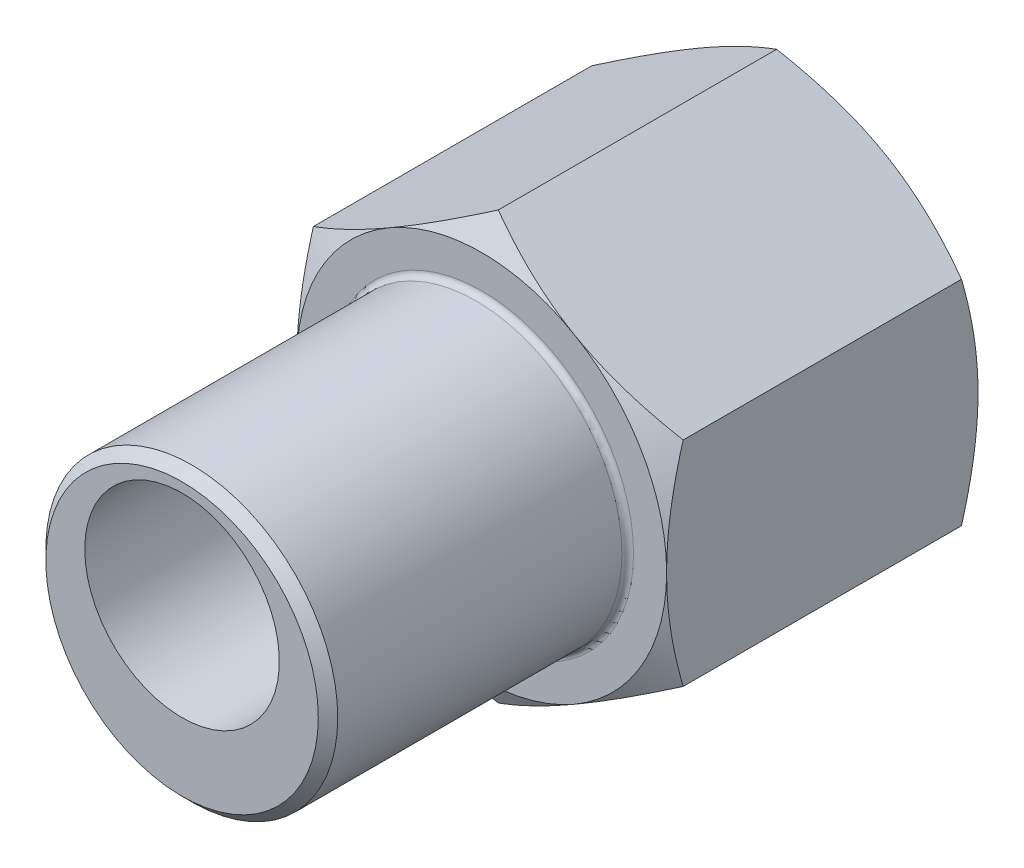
ISO-10303-21;
HEADER;
FILE_DESCRIPTION(('STEP AP214'),'2;1');
FILE_NAME('part.step','',(''),(''),'','','');
FILE_SCHEMA(('AUTOMOTIVE_DESIGN { 1 0 10303 214 1 1 1 1 }'));
ENDSEC;
DATA;
#1=APPLICATION_CONTEXT('core data for automotive mechanical design processes');
#2=APPLICATION_PROTOCOL_DEFINITION('international standard','automotive_design',2000,#1);
#3=PRODUCT_CONTEXT('',#1,'mechanical');
#4=PRODUCT('Part','Part','',(#3));
#5=PRODUCT_RELATED_PRODUCT_CATEGORY('part','',(#4));
#6=PRODUCT_DEFINITION_FORMATION('','',#4);
#7=PRODUCT_DEFINITION_CONTEXT('part definition',#1,'design');
#8=PRODUCT_DEFINITION('design','',#6,#7);
#9=PRODUCT_DEFINITION_SHAPE('','',#8);
#10=(LENGTH_UNIT() NAMED_UNIT(*) SI_UNIT(.MILLI.,.METRE.));
#11=(NAMED_UNIT(*) PLANE_ANGLE_UNIT() SI_UNIT($,.RADIAN.));
#12=(NAMED_UNIT(*) SI_UNIT($,.STERADIAN.) SOLID_ANGLE_UNIT());
#13=UNCERTAINTY_MEASURE_WITH_UNIT(LENGTH_MEASURE(1.E-05),#10,'distance_accuracy_value','');
#14=(GEOMETRIC_REPRESENTATION_CONTEXT(3) GLOBAL_UNCERTAINTY_ASSIGNED_CONTEXT((#13)) GLOBAL_UNIT_ASSIGNED_CONTEXT((#10,
#11,#12)) REPRESENTATION_CONTEXT('',''));
#15=CARTESIAN_POINT('',(0.,0.,0.));
#16=DIRECTION('',(0.,0.,1.));
#17=DIRECTION('',(1.,0.,0.));
#18=AXIS2_PLACEMENT_3D('',#15,#16,#17);
#19=CARTESIAN_POINT('',(-9.5,3.98482755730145,31.4));
#20=DIRECTION('',(-0.5,0.866025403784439,0.));
#21=DIRECTION('',(0.866025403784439,0.5,0.));
#22=AXIS2_PLACEMENT_3D('',#19,#20,#21);
#23=PLANE('',#22);
#24=DIRECTION('',(0.,0.,-1.));
#25=VECTOR('',#24,1.);
#26=CARTESIAN_POINT('',(0.,9.4696551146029,31.4));
#27=LINE('',#26,#25);
#28=CARTESIAN_POINT('',(0.,9.4696551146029,15.1514942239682));
#29=VERTEX_POINT('',#28);
#30=CARTESIAN_POINT('',(0.,9.4696551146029,0.848505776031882));
#31=VERTEX_POINT('',#30);
#32=EDGE_CURVE('E230',#29,#31,#27,.T.);
#33=ORIENTED_EDGE('',*,*,#32,.T.);
#34=CARTESIAN_POINT('',(0.000200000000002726,9.46977058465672,0.848572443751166));
#35=CARTESIAN_POINT('',(-0.208630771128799,9.34920208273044,0.778973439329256));
#36=CARTESIAN_POINT('',(-0.418240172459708,9.22818403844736,0.712533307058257));
#37=CARTESIAN_POINT('',(-0.839139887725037,8.98517747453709,0.586847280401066));
#38=CARTESIAN_POINT('',(-1.05043073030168,8.86318864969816,0.527603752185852));
#39=CARTESIAN_POINT('',(-1.68770779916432,8.49525656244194,0.361814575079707));
#40=CARTESIAN_POINT('',(-2.11620976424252,8.24786083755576,0.267514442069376));
#41=CARTESIAN_POINT('',(-2.75744333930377,7.87764446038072,0.156938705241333));
#42=CARTESIAN_POINT('',(-2.96825921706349,7.7559298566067,0.125439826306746));
#43=CARTESIAN_POINT('',(-3.39086703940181,7.51193711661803,0.0726182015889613));
#44=CARTESIAN_POINT('',(-3.60265900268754,7.38965896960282,0.0512956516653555));
#45=CARTESIAN_POINT('',(-4.02659621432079,7.14489870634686,0.0193730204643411));
#46=CARTESIAN_POINT('',(-4.23874074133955,7.02241700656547,0.0087601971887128));
#47=CARTESIAN_POINT('',(-4.66322575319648,6.77734047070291,-0.00151746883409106));
#48=CARTESIAN_POINT('',(-4.87556623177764,6.65474563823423,-0.00118264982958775));
#49=CARTESIAN_POINT('',(-5.27254199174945,6.42555157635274,0.00967336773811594));
#50=CARTESIAN_POINT('',(-5.45720529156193,6.31893617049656,0.0188702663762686));
#51=CARTESIAN_POINT('',(-5.82610000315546,6.10595470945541,0.0453653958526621));
#52=CARTESIAN_POINT('',(-6.01033138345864,5.99958867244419,0.062664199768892));
#53=CARTESIAN_POINT('',(-6.562311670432,5.68090270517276,0.126304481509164));
#54=CARTESIAN_POINT('',(-6.92908353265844,5.46914687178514,0.184381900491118));
#55=CARTESIAN_POINT('',(-7.66651782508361,5.04338898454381,0.329576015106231));
#56=CARTESIAN_POINT('',(-8.03708614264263,4.82944126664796,0.417308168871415));
#57=CARTESIAN_POINT('',(-8.77269671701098,4.40473630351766,0.616423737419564));
#58=CARTESIAN_POINT('',(-9.137748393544,4.19397361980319,0.727760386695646));
#59=CARTESIAN_POINT('',(-9.5002,3.98471208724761,0.848572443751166));
#60=B_SPLINE_CURVE_WITH_KNOTS('',3,(#34,#35,#36,#37,#38,#39,#40,#41,#42,#43,#44,#45,#46,#47,#48,
#49,#50,#51,#52,#53,#54,#55,#56,#57,#58,#59),.UNSPECIFIED.,.F.,.F.,(4,2,2,2,2,2,2,2,2,2,2,2,4),
(0.,0.752880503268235,1.50600787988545,3.0154687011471,3.75167336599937,4.48789219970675,
5.22323407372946,5.95855322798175,6.59868084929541,7.23885375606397,8.52010929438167,
9.82978009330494,11.1368800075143),.UNSPECIFIED.);
#61=CARTESIAN_POINT('',(-4.75,6.72724133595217,0.));
#62=VERTEX_POINT('',#61);
#63=EDGE_CURVE('E36',#31,#62,#60,.T.);
#64=ORIENTED_EDGE('',*,*,#63,.T.);
#65=CARTESIAN_POINT('',(-9.5,3.98482755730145,0.848505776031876));
#66=VERTEX_POINT('',#65);
#67=EDGE_CURVE('E187',#62,#66,#60,.T.);
#68=ORIENTED_EDGE('',*,*,#67,.T.);
#69=DIRECTION('',(0.,0.,-1.));
#70=VECTOR('',#69,1.);
#71=CARTESIAN_POINT('',(-9.5,3.98482755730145,31.4));
#72=LINE('',#71,#70);
#73=CARTESIAN_POINT('',(-9.5,3.98482755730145,15.1514942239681));
#74=VERTEX_POINT('',#73);
#75=EDGE_CURVE('E234',#74,#66,#72,.T.);
#76=ORIENTED_EDGE('',*,*,#75,.F.);
#77=CARTESIAN_POINT('',(-9.5002,3.98471208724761,15.1514275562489));
#78=CARTESIAN_POINT('',(-9.2913692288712,4.1052805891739,15.2210265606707));
#79=CARTESIAN_POINT('',(-9.08175982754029,4.22629863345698,15.2874666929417));
#80=CARTESIAN_POINT('',(-8.66086011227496,4.46930519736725,15.4131527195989));
#81=CARTESIAN_POINT('',(-8.44956926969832,4.59129402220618,15.4723962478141));
#82=CARTESIAN_POINT('',(-7.81229220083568,4.9592261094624,15.6381854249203));
#83=CARTESIAN_POINT('',(-7.38379023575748,5.20662183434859,15.7324855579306));
#84=CARTESIAN_POINT('',(-6.74255666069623,5.57683821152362,15.8430612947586));
#85=CARTESIAN_POINT('',(-6.53174078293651,5.69855281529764,15.8745601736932));
#86=CARTESIAN_POINT('',(-6.10913296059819,5.94254555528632,15.927381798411));
#87=CARTESIAN_POINT('',(-5.89734099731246,6.06482370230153,15.9487043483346));
#88=CARTESIAN_POINT('',(-5.47340378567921,6.30958396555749,15.9806269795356));
#89=CARTESIAN_POINT('',(-5.26125925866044,6.43206566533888,15.9912398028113));
#90=CARTESIAN_POINT('',(-4.83677424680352,6.67714220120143,16.0015174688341));
#91=CARTESIAN_POINT('',(-4.62443376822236,6.79973703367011,16.0011826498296));
#92=CARTESIAN_POINT('',(-4.22745800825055,7.0289310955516,15.9903266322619));
#93=CARTESIAN_POINT('',(-4.04279470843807,7.13554650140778,15.9811297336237));
#94=CARTESIAN_POINT('',(-3.67389999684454,7.34852796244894,15.9546346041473));
#95=CARTESIAN_POINT('',(-3.48966861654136,7.45489399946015,15.9373358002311));
#96=CARTESIAN_POINT('',(-2.937688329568,7.77357996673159,15.8736955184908));
#97=CARTESIAN_POINT('',(-2.57091646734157,7.9853358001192,15.8156180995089));
#98=CARTESIAN_POINT('',(-1.83348217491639,8.41109368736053,15.6704239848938));
#99=CARTESIAN_POINT('',(-1.46291385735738,8.62504140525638,15.5826918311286));
#100=CARTESIAN_POINT('',(-0.727303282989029,9.04974636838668,15.3835762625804));
#101=CARTESIAN_POINT('',(-0.362251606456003,9.26050905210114,15.2722396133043));
#102=CARTESIAN_POINT('',(0.000200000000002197,9.46977058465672,15.1514275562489));
#103=B_SPLINE_CURVE_WITH_KNOTS('',3,(#77,#78,#79,#80,#81,#82,#83,#84,#85,#86,#87,#88,#89,#90,
#91,#92,#93,#94,#95,#96,#97,#98,#99,#100,#101,#102),.UNSPECIFIED.,.F.,.F.,(4,2,2,2,2,2,2,2,2,2,
2,2,4),(0.,0.752880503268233,1.50600787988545,3.01546870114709,3.75167336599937,
4.48789219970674,5.22323407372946,5.95855322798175,6.5986808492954,7.23885375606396,
8.52010929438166,9.82978009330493,11.1368800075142),.UNSPECIFIED.);
#104=CARTESIAN_POINT('',(-4.75,6.72724133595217,16.));
#105=VERTEX_POINT('',#104);
#106=EDGE_CURVE('E285',#74,#105,#103,.T.);
#107=ORIENTED_EDGE('',*,*,#106,.T.);
#108=EDGE_CURVE('E278',#105,#29,#103,.T.);
#109=ORIENTED_EDGE('',*,*,#108,.T.);
#110=EDGE_LOOP('',(#33,#64,#68,#76,#107,#109));
#111=FACE_BOUND('',#110,.T.);
#112=ADVANCED_FACE('F14',(#111),#23,.T.);
#113=CARTESIAN_POINT('',(-9.5,-6.98482755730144,31.4));
#114=DIRECTION('',(-1.,0.,0.));
#115=DIRECTION('',(0.,1.,0.));
#116=AXIS2_PLACEMENT_3D('',#113,#114,#115);
#117=PLANE('',#116);
#118=ORIENTED_EDGE('',*,*,#75,.T.);
#119=CARTESIAN_POINT('',(-9.5,-16.2594980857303,4.64915461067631));
#120=CARTESIAN_POINT('',(-9.5,-16.0519345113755,4.54838890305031));
#121=CARTESIAN_POINT('',(-9.5,-15.8441280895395,4.44812365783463));
#122=CARTESIAN_POINT('',(-9.5,-15.4279788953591,4.24870738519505));
#123=CARTESIAN_POINT('',(-9.5,-15.2196361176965,4.14955636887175));
#124=CARTESIAN_POINT('',(-9.5,-14.5936721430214,3.85391863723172));
#125=CARTESIAN_POINT('',(-9.5,-14.1751762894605,3.65927692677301));
#126=CARTESIAN_POINT('',(-9.5,-13.333128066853,3.27504312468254));
#127=CARTESIAN_POINT('',(-9.5,-12.9095605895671,3.08548406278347));
#128=CARTESIAN_POINT('',(-9.5,-12.0590668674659,2.71408454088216));
#129=CARTESIAN_POINT('',(-9.5,-11.6321407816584,2.53224371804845));
#130=CARTESIAN_POINT('',(-9.5,-10.760347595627,2.17258687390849));
#131=CARTESIAN_POINT('',(-9.5,-10.3153472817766,1.99509199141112));
#132=CARTESIAN_POINT('',(-9.5,-9.42015134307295,1.65347114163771));
#133=CARTESIAN_POINT('',(-9.5,-8.96995514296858,1.48934667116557));
#134=CARTESIAN_POINT('',(-9.5,-8.0644798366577,1.17875663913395));
#135=CARTESIAN_POINT('',(-9.5,-7.60921304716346,1.03225555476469));
#136=CARTESIAN_POINT('',(-9.5,-6.69216497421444,0.761593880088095));
#137=CARTESIAN_POINT('',(-9.5,-6.23038578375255,0.637426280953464));
#138=CARTESIAN_POINT('',(-9.5,-5.30255333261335,0.418045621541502));
#139=CARTESIAN_POINT('',(-9.5,-4.83653861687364,0.322673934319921));
#140=CARTESIAN_POINT('',(-9.5,-4.13325149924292,0.205326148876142));
#141=CARTESIAN_POINT('',(-9.5,-3.89809450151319,0.170493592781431));
#142=CARTESIAN_POINT('',(-9.5,-3.4266026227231,0.110080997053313));
#143=CARTESIAN_POINT('',(-9.5,-3.19026785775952,0.08450006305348));
#144=CARTESIAN_POINT('',(-9.5,-2.71983579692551,0.0434225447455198));
#145=CARTESIAN_POINT('',(-9.5,-2.4857496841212,0.0277983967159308));
#146=CARTESIAN_POINT('',(-9.5,-2.01712646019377,0.00646452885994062));
#147=CARTESIAN_POINT('',(-9.5,-1.78258935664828,0.000754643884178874));
#148=CARTESIAN_POINT('',(-9.5,-1.31348386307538,-0.000614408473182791));
#149=CARTESIAN_POINT('',(-9.5,-1.07891547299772,0.00372644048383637));
#150=CARTESIAN_POINT('',(-9.5,-0.610170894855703,0.0223523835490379));
#151=CARTESIAN_POINT('',(-9.5,-0.375994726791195,0.0366379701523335));
#152=CARTESIAN_POINT('',(-9.5,0.186009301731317,0.0825527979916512));
#153=CARTESIAN_POINT('',(-9.5,0.513463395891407,0.118856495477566));
#154=CARTESIAN_POINT('',(-9.5,1.16594317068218,0.208934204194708));
#155=CARTESIAN_POINT('',(-9.5,1.49096851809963,0.262710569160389));
#156=CARTESIAN_POINT('',(-9.5,2.46202990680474,0.447397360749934));
#157=CARTESIAN_POINT('',(-9.5,3.10368871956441,0.601631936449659));
#158=CARTESIAN_POINT('',(-9.5,4.06314377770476,0.869114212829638));
#159=CARTESIAN_POINT('',(-9.5,4.38591638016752,0.965538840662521));
#160=CARTESIAN_POINT('',(-9.5,5.02832689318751,1.16841160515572));
#161=CARTESIAN_POINT('',(-9.5,5.34796478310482,1.27485980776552));
#162=CARTESIAN_POINT('',(-9.5,5.98420588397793,1.49607113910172));
#163=CARTESIAN_POINT('',(-9.49999999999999,6.30081005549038,1.61083153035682));
#164=CARTESIAN_POINT('',(-9.5,6.93139503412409,1.84731616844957));
#165=CARTESIAN_POINT('',(-9.5,7.24537587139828,1.96904033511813));
#166=CARTESIAN_POINT('',(-9.5,7.98380007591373,2.2632355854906));
#167=CARTESIAN_POINT('',(-9.5,8.4072560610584,2.4381803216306));
#168=CARTESIAN_POINT('',(-9.49999999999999,9.25057638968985,2.79654711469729));
#169=CARTESIAN_POINT('',(-9.49999999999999,9.67044051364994,2.97996968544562));
#170=CARTESIAN_POINT('',(-9.49999999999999,10.5072421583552,3.35360200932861));
#171=CARTESIAN_POINT('',(-9.49999999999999,10.9241790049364,3.54381326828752));
#172=CARTESIAN_POINT('',(-9.49999999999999,11.7555186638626,3.92965926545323));
#173=CARTESIAN_POINT('',(-9.49999999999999,12.1699215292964,4.12529388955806));
#174=CARTESIAN_POINT('',(-9.49999999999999,12.9970629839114,4.52119244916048));
#175=CARTESIAN_POINT('',(-9.49999999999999,13.4097992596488,4.72146120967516));
#176=CARTESIAN_POINT('',(-9.49999999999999,14.2334884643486,5.12563240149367));
#177=CARTESIAN_POINT('',(-9.49999999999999,14.6444413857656,5.32953484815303));
#178=CARTESIAN_POINT('',(-9.49999999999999,15.4647841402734,5.7403261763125));
#179=CARTESIAN_POINT('',(-9.49999999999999,15.8741741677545,5.94721467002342));
#180=CARTESIAN_POINT('',(-9.49999999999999,16.6916690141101,6.36351681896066));
#181=CARTESIAN_POINT('',(-9.49999999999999,17.0997738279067,6.57293048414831));
#182=CARTESIAN_POINT('',(-9.49999999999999,18.2543578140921,7.16919322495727));
#183=CARTESIAN_POINT('',(-9.49999999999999,18.9995437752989,7.55854639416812));
#184=CARTESIAN_POINT('',(-9.49999999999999,20.4871317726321,8.34258559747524));
#185=CARTESIAN_POINT('',(-9.49999999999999,21.2295337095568,8.73727181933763));
#186=CARTESIAN_POINT('',(-9.49999999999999,22.7103037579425,9.529741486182));
#187=CARTESIAN_POINT('',(-9.49999999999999,23.4486773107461,9.92751477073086));
#188=CARTESIAN_POINT('',(-9.49999999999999,24.5549230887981,10.5265511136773));
#189=CARTESIAN_POINT('',(-9.49999999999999,24.923442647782,10.7266205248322));
#190=CARTESIAN_POINT('',(-9.49999999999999,25.6600930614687,11.1274723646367));
#191=CARTESIAN_POINT('',(-9.49999999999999,26.0282239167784,11.3282547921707));
#192=CARTESIAN_POINT('',(-9.5,26.396182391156,11.5293527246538));
#193=B_SPLINE_CURVE_WITH_KNOTS('',3,(#119,#120,#121,#122,#123,#124,#125,#126,#127,#128,#129,
#130,#131,#132,#133,#134,#135,#136,#137,#138,#139,#140,#141,#142,#143,#144,#145,#146,#147,#148,
#149,#150,#151,#152,#153,#154,#155,#156,#157,#158,#159,#160,#161,#162,#163,#164,#165,#166,#167,
#168,#169,#170,#171,#172,#173,#174,#175,#176,#177,#178,#179,#180,#181,#182,#183,#184,#185,#186,
#187,#188,#189,#190,#191,#192),.UNSPECIFIED.,.F.,.F.,(4,2,2,2,2,2,2,2,2,2,2,2,2,2,2,2,2,2,2,2,2,
2,2,2,2,2,2,2,2,2,2,2,2,2,2,2,4),(0.,0.692188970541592,1.38438483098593,2.76898002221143,
4.16106867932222,5.55309182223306,6.99020295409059,8.42747474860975,9.86179913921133,
11.2956726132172,12.72149686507,13.4345118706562,14.1474579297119,14.851075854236,
15.5546820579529,16.258289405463,16.9619316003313,17.9497550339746,18.9377115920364,
20.9147121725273,21.9252307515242,22.9357559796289,23.9459499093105,24.9561322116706,
26.3305209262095,27.7049930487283,29.0797719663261,30.4545219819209,31.8307742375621,
33.2070323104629,34.5831132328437,35.959199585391,38.4814837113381,41.0038568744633,
43.519948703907,44.7779266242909,46.0359025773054),.UNSPECIFIED.);
#194=CARTESIAN_POINT('',(-9.5,-1.5,0.));
#195=VERTEX_POINT('',#194);
#196=EDGE_CURVE('E185',#66,#195,#193,.F.);
#197=ORIENTED_EDGE('',*,*,#196,.T.);
#198=CARTESIAN_POINT('',(-9.5,-6.98482755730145,0.848505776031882));
#199=VERTEX_POINT('',#198);
#200=EDGE_CURVE('E178',#195,#199,#193,.F.);
#201=ORIENTED_EDGE('',*,*,#200,.T.);
#202=DIRECTION('',(0.,0.,-1.));
#203=VECTOR('',#202,1.);
#204=CARTESIAN_POINT('',(-9.5,-6.98482755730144,31.4));
#205=LINE('',#204,#203);
#206=CARTESIAN_POINT('',(-9.5,-6.98482755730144,15.1514942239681));
#207=VERTEX_POINT('',#206);
#208=EDGE_CURVE('E238',#207,#199,#205,.T.);
#209=ORIENTED_EDGE('',*,*,#208,.F.);
#210=CARTESIAN_POINT('',(-9.5,-16.2174881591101,11.3712317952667));
#211=CARTESIAN_POINT('',(-9.5,-16.0101004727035,11.4718279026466));
#212=CARTESIAN_POINT('',(-9.5,-15.8024690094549,11.5719212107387));
#213=CARTESIAN_POINT('',(-9.5,-15.3866676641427,11.7709883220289));
#214=CARTESIAN_POINT('',(-9.5,-15.1784977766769,11.8699621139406));
#215=CARTESIAN_POINT('',(-9.5,-14.5530485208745,12.1650595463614));
#216=CARTESIAN_POINT('',(-9.5,-14.1348911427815,12.3593292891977));
#217=CARTESIAN_POINT('',(-9.5,-13.2934898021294,12.7427966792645));
#218=CARTESIAN_POINT('',(-9.5,-12.8702305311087,12.9319608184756));
#219=CARTESIAN_POINT('',(-9.5,-12.0203409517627,13.3025305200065));
#220=CARTESIAN_POINT('',(-9.5,-11.593710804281,13.4839364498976));
#221=CARTESIAN_POINT('',(-9.5,-10.7226713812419,13.8425889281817));
#222=CARTESIAN_POINT('',(-9.5,-10.278130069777,14.0195165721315));
#223=CARTESIAN_POINT('',(-9.5,-9.38384198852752,14.3599441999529));
#224=CARTESIAN_POINT('',(-9.5,-8.93409464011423,14.5234426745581));
#225=CARTESIAN_POINT('',(-9.5,-8.02952032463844,14.8327075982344));
#226=CARTESIAN_POINT('',(-9.5,-7.57470581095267,14.978510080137));
#227=CARTESIAN_POINT('',(-9.5,-6.65856902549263,15.2476962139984));
#228=CARTESIAN_POINT('',(-9.5,-6.19724885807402,15.3710869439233));
#229=CARTESIAN_POINT('',(-9.5,-5.27032905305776,15.5888517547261));
#230=CARTESIAN_POINT('',(-9.5,-4.80476740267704,15.6833831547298));
#231=CARTESIAN_POINT('',(-9.5,-4.10219762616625,15.7994376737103));
#232=CARTESIAN_POINT('',(-9.5,-3.86728573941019,15.8338336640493));
#233=CARTESIAN_POINT('',(-9.5,-3.39629956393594,15.8933697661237));
#234=CARTESIAN_POINT('',(-9.5,-3.16022538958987,15.9185107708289));
#235=CARTESIAN_POINT('',(-9.5,-2.69030776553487,15.9587215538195));
#236=CARTESIAN_POINT('',(-9.5,-2.45647519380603,15.9739179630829));
#237=CARTESIAN_POINT('',(-9.5,-1.98837701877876,15.9944099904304));
#238=CARTESIAN_POINT('',(-9.5,-1.7541114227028,15.9997057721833));
#239=CARTESIAN_POINT('',(-9.5,-1.2855658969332,16.0002703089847));
#240=CARTESIAN_POINT('',(-9.5,-1.0512859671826,15.9955390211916));
#241=CARTESIAN_POINT('',(-9.5,-0.583133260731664,15.9761646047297));
#242=CARTESIAN_POINT('',(-9.5,-0.349260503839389,15.961521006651));
#243=CARTESIAN_POINT('',(-9.5,0.213286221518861,15.9146862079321));
#244=CARTESIAN_POINT('',(-9.5,0.541573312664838,15.8777654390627));
#245=CARTESIAN_POINT('',(-9.5,1.19570274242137,15.78640745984));
#246=CARTESIAN_POINT('',(-9.5,1.52154474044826,15.7319678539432));
#247=CARTESIAN_POINT('',(-9.5,2.17047657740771,15.6075088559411));
#248=CARTESIAN_POINT('',(-9.5,2.49356405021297,15.5374772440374));
#249=CARTESIAN_POINT('',(-9.5,3.13649383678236,15.383970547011));
#250=CARTESIAN_POINT('',(-9.5,3.45633620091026,15.3004956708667));
#251=CARTESIAN_POINT('',(-9.5,4.09977875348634,15.1201684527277));
#252=CARTESIAN_POINT('',(-9.5,4.4233074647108,15.023062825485));
#253=CARTESIAN_POINT('',(-9.5,5.06717767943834,14.8188580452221));
#254=CARTESIAN_POINT('',(-9.5,5.38751916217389,14.7117588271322));
#255=CARTESIAN_POINT('',(-9.5,6.02517371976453,14.489263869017));
#256=CARTESIAN_POINT('',(-9.49999999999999,6.34248777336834,14.3738709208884));
#257=CARTESIAN_POINT('',(-9.5,6.97448940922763,14.1361421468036));
#258=CARTESIAN_POINT('',(-9.5,7.28917701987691,14.0138063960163));
#259=CARTESIAN_POINT('',(-9.5,8.02192954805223,13.7211215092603));
#260=CARTESIAN_POINT('',(-9.5,8.43908112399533,13.5484894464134));
#261=CARTESIAN_POINT('',(-9.49999999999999,9.26990867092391,13.1950318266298));
#262=CARTESIAN_POINT('',(-9.49999999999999,9.68358443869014,13.0142057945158));
#263=CARTESIAN_POINT('',(-9.49999999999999,10.5080938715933,12.6459726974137));
#264=CARTESIAN_POINT('',(-9.49999999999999,10.9189269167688,12.4585642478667));
#265=CARTESIAN_POINT('',(-9.49999999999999,11.7381286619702,12.0784703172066));
#266=CARTESIAN_POINT('',(-9.49999999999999,12.1464974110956,11.8857849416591));
#267=CARTESIAN_POINT('',(-9.49999999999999,12.9616011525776,11.4959044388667));
#268=CARTESIAN_POINT('',(-9.49999999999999,13.3683339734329,11.2987047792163));
#269=CARTESIAN_POINT('',(-9.49999999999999,14.1800542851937,10.9007471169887));
#270=CARTESIAN_POINT('',(-9.49999999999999,14.5850417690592,10.6999891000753));
#271=CARTESIAN_POINT('',(-9.49999999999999,15.7976981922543,10.0933585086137));
#272=CARTESIAN_POINT('',(-9.49999999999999,16.6031630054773,9.6830802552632));
#273=CARTESIAN_POINT('',(-9.49999999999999,18.1439788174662,8.88817516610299));
#274=CARTESIAN_POINT('',(-9.49999999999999,18.8796677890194,8.50420054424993));
#275=CARTESIAN_POINT('',(-9.49999999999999,20.3482872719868,7.73095632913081));
#276=CARTESIAN_POINT('',(-9.49999999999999,21.0812176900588,7.34168655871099));
#277=CARTESIAN_POINT('',(-9.49999999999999,22.5431501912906,6.56004992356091));
#278=CARTESIAN_POINT('',(-9.49999999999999,23.272157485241,6.16769278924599));
#279=CARTESIAN_POINT('',(-9.49999999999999,24.7284020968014,5.37979882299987));
#280=CARTESIAN_POINT('',(-9.49999999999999,25.4556395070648,4.98426216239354));
#281=CARTESIAN_POINT('',(-9.5,26.1822226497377,4.5875353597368));
#282=B_SPLINE_CURVE_WITH_KNOTS('',3,(#210,#211,#212,#213,#214,#215,#216,#217,#218,#219,#220,
#221,#222,#223,#224,#225,#226,#227,#228,#229,#230,#231,#232,#233,#234,#235,#236,#237,#238,#239,
#240,#241,#242,#243,#244,#245,#246,#247,#248,#249,#250,#251,#252,#253,#254,#255,#256,#257,#258,
#259,#260,#261,#262,#263,#264,#265,#266,#267,#268,#269,#270,#271,#272,#273,#274,#275,#276,#277,
#278,#279,#280,#281),.UNSPECIFIED.,.F.,.F.,(4,2,2,2,2,2,2,2,2,2,2,2,2,2,2,2,2,2,2,2,2,2,2,2,2,2,
2,2,2,2,2,2,2,2,2,4),(0.,0.691492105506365,1.38299117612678,2.76619475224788,4.15695502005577,
5.54764932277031,6.9828497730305,8.41821130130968,9.85059926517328,11.2825340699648,
12.7065176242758,13.4186140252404,14.1306417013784,14.8334165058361,15.5361796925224,
16.2389458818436,16.9417453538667,17.9322670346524,18.9229242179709,19.9143605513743,
20.905781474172,21.9189506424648,22.9321264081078,23.9449626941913,24.9577880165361,
26.3120540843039,27.6663987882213,29.0210300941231,30.3756343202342,31.7316640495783,
33.0876992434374,35.799430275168,38.2890001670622,40.7786535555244,43.2623041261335,
45.7458217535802),.UNSPECIFIED.);
#283=CARTESIAN_POINT('',(-9.5,-1.5,16.));
#284=VERTEX_POINT('',#283);
#285=EDGE_CURVE('E211',#207,#284,#282,.T.);
#286=ORIENTED_EDGE('',*,*,#285,.T.);
#287=EDGE_CURVE('E203',#284,#74,#282,.T.);
#288=ORIENTED_EDGE('',*,*,#287,.T.);
#289=EDGE_LOOP('',(#118,#197,#201,#209,#286,#288));
#290=FACE_BOUND('',#289,.T.);
#291=ADVANCED_FACE('F194',(#290),#117,.T.);
#292=CARTESIAN_POINT('',(0.,-12.4696551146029,31.4));
#293=DIRECTION('',(-0.5,-0.866025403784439,0.));
#294=DIRECTION('',(-0.866025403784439,0.5,0.));
#295=AXIS2_PLACEMENT_3D('',#292,#293,#294);
#296=PLANE('',#295);
#297=ORIENTED_EDGE('',*,*,#208,.T.);
#298=CARTESIAN_POINT('',(-9.5002,-6.98471208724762,0.848572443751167));
#299=CARTESIAN_POINT('',(-9.2913692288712,-7.10528058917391,0.778973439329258));
#300=CARTESIAN_POINT('',(-9.08175982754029,-7.22629863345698,0.712533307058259));
#301=CARTESIAN_POINT('',(-8.66086011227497,-7.46930519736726,0.586847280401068));
#302=CARTESIAN_POINT('',(-8.44956926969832,-7.59129402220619,0.527603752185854));
#303=CARTESIAN_POINT('',(-7.81229220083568,-7.95922610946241,0.361814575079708));
#304=CARTESIAN_POINT('',(-7.38379023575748,-8.20662183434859,0.267514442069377));
#305=CARTESIAN_POINT('',(-6.74255666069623,-8.57683821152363,0.156938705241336));
#306=CARTESIAN_POINT('',(-6.53174078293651,-8.69855281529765,0.125439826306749));
#307=CARTESIAN_POINT('',(-6.10913296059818,-8.94254555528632,0.0726182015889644));
#308=CARTESIAN_POINT('',(-5.89734099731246,-9.06482370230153,0.0512956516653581));
#309=CARTESIAN_POINT('',(-5.47340378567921,-9.30958396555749,0.019373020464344));
#310=CARTESIAN_POINT('',(-5.26125925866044,-9.43206566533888,0.00876019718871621));
#311=CARTESIAN_POINT('',(-4.83677424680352,-9.67714220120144,-0.0015174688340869));
#312=CARTESIAN_POINT('',(-4.62443376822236,-9.79973703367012,-0.00118264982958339));
#313=CARTESIAN_POINT('',(-4.22745800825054,-10.0289310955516,0.00967336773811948));
#314=CARTESIAN_POINT('',(-4.04279470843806,-10.1355465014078,0.0188702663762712));
#315=CARTESIAN_POINT('',(-3.67389999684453,-10.3485279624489,0.045365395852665));
#316=CARTESIAN_POINT('',(-3.48966861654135,-10.4548939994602,0.062664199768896));
#317=CARTESIAN_POINT('',(-2.93768832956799,-10.7735799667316,0.126304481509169));
#318=CARTESIAN_POINT('',(-2.57091646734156,-10.9853358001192,0.184381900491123));
#319=CARTESIAN_POINT('',(-1.83348217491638,-11.4110936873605,0.329576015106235));
#320=CARTESIAN_POINT('',(-1.46291385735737,-11.6250414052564,0.417308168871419));
#321=CARTESIAN_POINT('',(-0.727303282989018,-12.0497463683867,0.616423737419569));
#322=CARTESIAN_POINT('',(-0.362251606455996,-12.2605090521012,0.727760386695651));
#323=CARTESIAN_POINT('',(0.000200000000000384,-12.4697705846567,0.84857244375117));
#324=B_SPLINE_CURVE_WITH_KNOTS('',3,(#298,#299,#300,#301,#302,#303,#304,#305,#306,#307,#308,
#309,#310,#311,#312,#313,#314,#315,#316,#317,#318,#319,#320,#321,#322,#323),.UNSPECIFIED.,.F.,
.F.,(4,2,2,2,2,2,2,2,2,2,2,2,4),(0.,0.752880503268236,1.50600787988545,3.0154687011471,
3.75167336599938,4.48789219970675,5.22323407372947,5.95855322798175,6.59868084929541,
7.23885375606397,8.52010929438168,9.82978009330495,11.1368800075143),.UNSPECIFIED.);
#325=CARTESIAN_POINT('',(-4.75,-9.72724133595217,0.));
#326=VERTEX_POINT('',#325);
#327=EDGE_CURVE('E186',#199,#326,#324,.T.);
#328=ORIENTED_EDGE('',*,*,#327,.T.);
#329=CARTESIAN_POINT('',(0.,-12.4696551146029,0.848505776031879));
#330=VERTEX_POINT('',#329);
#331=EDGE_CURVE('E171',#326,#330,#324,.T.);
#332=ORIENTED_EDGE('',*,*,#331,.T.);
#333=DIRECTION('',(0.,0.,-1.));
#334=VECTOR('',#333,1.);
#335=CARTESIAN_POINT('',(0.,-12.4696551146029,31.4));
#336=LINE('',#335,#334);
#337=CARTESIAN_POINT('',(0.,-12.4696551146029,15.1514942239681));
#338=VERTEX_POINT('',#337);
#339=EDGE_CURVE('E241',#338,#330,#336,.T.);
#340=ORIENTED_EDGE('',*,*,#339,.F.);
#341=CARTESIAN_POINT('',(0.000200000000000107,-12.4697705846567,15.1514275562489));
#342=CARTESIAN_POINT('',(-0.208630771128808,-12.3492020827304,15.2210265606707));
#343=CARTESIAN_POINT('',(-0.418240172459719,-12.2281840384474,15.2874666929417));
#344=CARTESIAN_POINT('',(-0.839139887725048,-11.9851774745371,15.4131527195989));
#345=CARTESIAN_POINT('',(-1.05043073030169,-11.8631886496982,15.4723962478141));
#346=CARTESIAN_POINT('',(-1.68770779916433,-11.4952565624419,15.6381854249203));
#347=CARTESIAN_POINT('',(-2.11620976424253,-11.2478608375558,15.7324855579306));
#348=CARTESIAN_POINT('',(-2.75744333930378,-10.8776444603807,15.8430612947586));
#349=CARTESIAN_POINT('',(-2.96825921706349,-10.7559298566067,15.8745601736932));
#350=CARTESIAN_POINT('',(-3.39086703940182,-10.511937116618,15.927381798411));
#351=CARTESIAN_POINT('',(-3.60265900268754,-10.3896589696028,15.9487043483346));
#352=CARTESIAN_POINT('',(-4.02659621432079,-10.1448987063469,15.9806269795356));
#353=CARTESIAN_POINT('',(-4.23874074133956,-10.0224170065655,15.9912398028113));
#354=CARTESIAN_POINT('',(-4.66322575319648,-9.77734047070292,16.0015174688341));
#355=CARTESIAN_POINT('',(-4.87556623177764,-9.65474563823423,16.0011826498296));
#356=CARTESIAN_POINT('',(-5.27254199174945,-9.42555157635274,15.9903266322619));
#357=CARTESIAN_POINT('',(-5.45720529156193,-9.31893617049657,15.9811297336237));
#358=CARTESIAN_POINT('',(-5.82610000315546,-9.10595470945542,15.9546346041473));
#359=CARTESIAN_POINT('',(-6.01033138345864,-8.9995886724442,15.9373358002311));
#360=CARTESIAN_POINT('',(-6.562311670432,-8.68090270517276,15.8736955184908));
#361=CARTESIAN_POINT('',(-6.92908353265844,-8.46914687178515,15.8156180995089));
#362=CARTESIAN_POINT('',(-7.66651782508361,-8.04338898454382,15.6704239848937));
#363=CARTESIAN_POINT('',(-8.03708614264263,-7.82944126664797,15.5826918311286));
#364=CARTESIAN_POINT('',(-8.77269671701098,-7.40473630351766,15.3835762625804));
#365=CARTESIAN_POINT('',(-9.137748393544,-7.1939736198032,15.2722396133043));
#366=CARTESIAN_POINT('',(-9.5002,-6.98471208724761,15.1514275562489));
#367=B_SPLINE_CURVE_WITH_KNOTS('',3,(#341,#342,#343,#344,#345,#346,#347,#348,#349,#350,#351,
#352,#353,#354,#355,#356,#357,#358,#359,#360,#361,#362,#363,#364,#365,#366),.UNSPECIFIED.,.F.,
.F.,(4,2,2,2,2,2,2,2,2,2,2,2,4),(0.,0.752880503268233,1.50600787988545,3.01546870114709,
3.75167336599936,4.48789219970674,5.22323407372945,5.95855322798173,6.59868084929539,
7.23885375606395,8.52010929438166,9.82978009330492,11.1368800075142),.UNSPECIFIED.);
#368=CARTESIAN_POINT('',(-4.75,-9.72724133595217,16.));
#369=VERTEX_POINT('',#368);
#370=EDGE_CURVE('E225',#338,#369,#367,.T.);
#371=ORIENTED_EDGE('',*,*,#370,.T.);
#372=EDGE_CURVE('E218',#369,#207,#367,.T.);
#373=ORIENTED_EDGE('',*,*,#372,.T.);
#374=EDGE_LOOP('',(#297,#328,#332,#340,#371,#373));
#375=FACE_BOUND('',#374,.T.);
#376=ADVANCED_FACE('F197',(#375),#296,.T.);
#377=CARTESIAN_POINT('',(9.5,-6.98482755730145,31.4));
#378=DIRECTION('',(0.5,-0.866025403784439,0.));
#379=DIRECTION('',(-0.866025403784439,-0.5,0.));
#380=AXIS2_PLACEMENT_3D('',#377,#378,#379);
#381=PLANE('',#380);
#382=ORIENTED_EDGE('',*,*,#339,.T.);
#383=CARTESIAN_POINT('',(-0.000199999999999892,-12.4697705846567,0.848572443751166));
#384=CARTESIAN_POINT('',(0.208630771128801,-12.3492020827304,0.778973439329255));
#385=CARTESIAN_POINT('',(0.41824017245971,-12.2281840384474,0.712533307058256));
#386=CARTESIAN_POINT('',(0.839139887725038,-11.9851774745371,0.586847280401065));
#387=CARTESIAN_POINT('',(1.05043073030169,-11.8631886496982,0.527603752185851));
#388=CARTESIAN_POINT('',(1.68770779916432,-11.4952565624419,0.361814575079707));
#389=CARTESIAN_POINT('',(2.11620976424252,-11.2478608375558,0.267514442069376));
#390=CARTESIAN_POINT('',(2.75744333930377,-10.8776444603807,0.156938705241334));
#391=CARTESIAN_POINT('',(2.96825921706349,-10.7559298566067,0.125439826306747));
#392=CARTESIAN_POINT('',(3.39086703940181,-10.511937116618,0.0726182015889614));
#393=CARTESIAN_POINT('',(3.60265900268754,-10.3896589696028,0.0512956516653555));
#394=CARTESIAN_POINT('',(4.02659621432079,-10.1448987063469,0.0193730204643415));
#395=CARTESIAN_POINT('',(4.23874074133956,-10.0224170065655,0.00876019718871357));
#396=CARTESIAN_POINT('',(4.66322575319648,-9.77734047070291,-0.00151746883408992));
#397=CARTESIAN_POINT('',(4.87556623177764,-9.65474563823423,-0.00118264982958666));
#398=CARTESIAN_POINT('',(5.27254199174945,-9.42555157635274,0.00967336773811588));
#399=CARTESIAN_POINT('',(5.45720529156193,-9.31893617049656,0.0188702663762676));
#400=CARTESIAN_POINT('',(5.82610000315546,-9.10595470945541,0.0453653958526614));
#401=CARTESIAN_POINT('',(6.01033138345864,-8.99958867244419,0.0626641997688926));
#402=CARTESIAN_POINT('',(6.562311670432,-8.68090270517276,0.126304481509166));
#403=CARTESIAN_POINT('',(6.92908353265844,-8.46914687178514,0.184381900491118));
#404=CARTESIAN_POINT('',(7.66651782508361,-8.04338898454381,0.32957601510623));
#405=CARTESIAN_POINT('',(8.03708614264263,-7.82944126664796,0.417308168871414));
#406=CARTESIAN_POINT('',(8.77269671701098,-7.40473630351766,0.616423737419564));
#407=CARTESIAN_POINT('',(9.137748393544,-7.19397361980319,0.727760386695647));
#408=CARTESIAN_POINT('',(9.5002,-6.98471208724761,0.848572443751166));
#409=B_SPLINE_CURVE_WITH_KNOTS('',3,(#383,#384,#385,#386,#387,#388,#389,#390,#391,#392,#393,
#394,#395,#396,#397,#398,#399,#400,#401,#402,#403,#404,#405,#406,#407,#408),.UNSPECIFIED.,.F.,
.F.,(4,2,2,2,2,2,2,2,2,2,2,2,4),(0.,0.752880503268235,1.50600787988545,3.01546870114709,
3.75167336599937,4.48789219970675,5.22323407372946,5.95855322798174,6.5986808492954,
7.23885375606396,8.52010929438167,9.82978009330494,11.1368800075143),.UNSPECIFIED.);
#410=CARTESIAN_POINT('',(4.75,-9.72724133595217,0.));
#411=VERTEX_POINT('',#410);
#412=EDGE_CURVE('E137',#330,#411,#409,.T.);
#413=ORIENTED_EDGE('',*,*,#412,.T.);
#414=CARTESIAN_POINT('',(9.5,-6.98482755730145,0.848505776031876));
#415=VERTEX_POINT('',#414);
#416=EDGE_CURVE('E122',#411,#415,#409,.T.);
#417=ORIENTED_EDGE('',*,*,#416,.T.);
#418=DIRECTION('',(0.,0.,-1.));
#419=VECTOR('',#418,1.);
#420=CARTESIAN_POINT('',(9.5,-6.98482755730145,31.4));
#421=LINE('',#420,#419);
#422=CARTESIAN_POINT('',(9.5,-6.98482755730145,15.1514942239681));
#423=VERTEX_POINT('',#422);
#424=EDGE_CURVE('E136',#423,#415,#421,.T.);
#425=ORIENTED_EDGE('',*,*,#424,.F.);
#426=CARTESIAN_POINT('',(9.5002,-6.98471208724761,15.1514275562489));
#427=CARTESIAN_POINT('',(9.2913692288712,-7.1052805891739,15.2210265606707));
#428=CARTESIAN_POINT('',(9.08175982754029,-7.22629863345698,15.2874666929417));
#429=CARTESIAN_POINT('',(8.66086011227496,-7.46930519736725,15.4131527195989));
#430=CARTESIAN_POINT('',(8.44956926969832,-7.59129402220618,15.4723962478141));
#431=CARTESIAN_POINT('',(7.81229220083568,-7.9592261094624,15.6381854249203));
#432=CARTESIAN_POINT('',(7.38379023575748,-8.20662183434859,15.7324855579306));
#433=CARTESIAN_POINT('',(6.74255666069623,-8.57683821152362,15.8430612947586));
#434=CARTESIAN_POINT('',(6.53174078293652,-8.69855281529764,15.8745601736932));
#435=CARTESIAN_POINT('',(6.10913296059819,-8.94254555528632,15.927381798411));
#436=CARTESIAN_POINT('',(5.89734099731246,-9.06482370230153,15.9487043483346));
#437=CARTESIAN_POINT('',(5.47340378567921,-9.30958396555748,15.9806269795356));
#438=CARTESIAN_POINT('',(5.26125925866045,-9.43206566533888,15.9912398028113));
#439=CARTESIAN_POINT('',(4.83677424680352,-9.67714220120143,16.0015174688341));
#440=CARTESIAN_POINT('',(4.62443376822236,-9.79973703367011,16.0011826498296));
#441=CARTESIAN_POINT('',(4.22745800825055,-10.0289310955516,15.9903266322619));
#442=CARTESIAN_POINT('',(4.04279470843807,-10.1355465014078,15.9811297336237));
#443=CARTESIAN_POINT('',(3.67389999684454,-10.3485279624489,15.9546346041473));
#444=CARTESIAN_POINT('',(3.48966861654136,-10.4548939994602,15.9373358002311));
#445=CARTESIAN_POINT('',(2.937688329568,-10.7735799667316,15.8736955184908));
#446=CARTESIAN_POINT('',(2.57091646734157,-10.9853358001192,15.8156180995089));
#447=CARTESIAN_POINT('',(1.83348217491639,-11.4110936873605,15.6704239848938));
#448=CARTESIAN_POINT('',(1.46291385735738,-11.6250414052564,15.5826918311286));
#449=CARTESIAN_POINT('',(0.727303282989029,-12.0497463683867,15.3835762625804));
#450=CARTESIAN_POINT('',(0.362251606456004,-12.2605090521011,15.2722396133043));
#451=CARTESIAN_POINT('',(-0.000199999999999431,-12.4697705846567,15.1514275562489));
#452=B_SPLINE_CURVE_WITH_KNOTS('',3,(#426,#427,#428,#429,#430,#431,#432,#433,#434,#435,#436,
#437,#438,#439,#440,#441,#442,#443,#444,#445,#446,#447,#448,#449,#450,#451),.UNSPECIFIED.,.F.,
.F.,(4,2,2,2,2,2,2,2,2,2,2,2,4),(0.,0.752880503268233,1.50600787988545,3.01546870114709,
3.75167336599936,4.48789219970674,5.22323407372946,5.95855322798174,6.5986808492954,
7.23885375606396,8.52010929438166,9.82978009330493,11.1368800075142),.UNSPECIFIED.);
#453=CARTESIAN_POINT('',(4.75,-9.72724133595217,16.));
#454=VERTEX_POINT('',#453);
#455=EDGE_CURVE('E212',#423,#454,#452,.T.);
#456=ORIENTED_EDGE('',*,*,#455,.T.);
#457=EDGE_CURVE('E226',#454,#338,#452,.T.);
#458=ORIENTED_EDGE('',*,*,#457,.T.);
#459=EDGE_LOOP('',(#382,#413,#417,#425,#456,#458));
#460=FACE_BOUND('',#459,.T.);
#461=ADVANCED_FACE('F335',(#460),#381,.T.);
#462=CARTESIAN_POINT('',(9.5,3.98482755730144,31.4));
#463=DIRECTION('',(1.,0.,0.));
#464=DIRECTION('',(0.,-1.,0.));
#465=AXIS2_PLACEMENT_3D('',#462,#463,#464);
#466=PLANE('',#465);
#467=ORIENTED_EDGE('',*,*,#424,.T.);
#468=CARTESIAN_POINT('',(9.5,-16.2594980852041,4.64915461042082));
#469=CARTESIAN_POINT('',(9.49999999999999,-16.0519345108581,4.54838890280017));
#470=CARTESIAN_POINT('',(9.49999999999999,-15.844128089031,4.44812365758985));
#471=CARTESIAN_POINT('',(9.49999999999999,-15.4279788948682,4.24870738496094));
#472=CARTESIAN_POINT('',(9.49999999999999,-15.2196361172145,4.14955636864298));
#473=CARTESIAN_POINT('',(9.5,-14.593672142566,3.85391863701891));
#474=CARTESIAN_POINT('',(9.49999999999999,-14.1751762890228,3.65927692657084));
#475=CARTESIAN_POINT('',(9.49999999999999,-13.3331280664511,3.27504312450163));
#476=CARTESIAN_POINT('',(9.49999999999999,-12.9095605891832,3.08548406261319));
#477=CARTESIAN_POINT('',(9.49999999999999,-12.0590668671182,2.71408454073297));
#478=CARTESIAN_POINT('',(9.49999999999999,-11.6321407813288,2.53224371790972));
#479=CARTESIAN_POINT('',(9.49999999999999,-10.7603475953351,2.17258687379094));
#480=CARTESIAN_POINT('',(9.49999999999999,-10.3153472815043,1.99509199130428));
#481=CARTESIAN_POINT('',(9.49999999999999,-9.42015134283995,1.6534711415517));
#482=CARTESIAN_POINT('',(9.5,-8.96995514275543,1.48934667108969));
#483=CARTESIAN_POINT('',(9.5,-8.0644798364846,1.17875663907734));
#484=CARTESIAN_POINT('',(9.49999999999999,-7.60921304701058,1.03225555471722));
#485=CARTESIAN_POINT('',(9.5,-6.69216497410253,0.761593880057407));
#486=CARTESIAN_POINT('',(9.5,-6.23038578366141,0.637426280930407));
#487=CARTESIAN_POINT('',(9.5,-5.30255333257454,0.418045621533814));
#488=CARTESIAN_POINT('',(9.5,-4.83653861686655,0.32267393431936));
#489=CARTESIAN_POINT('',(9.5,-4.13325149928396,0.205326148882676));
#490=CARTESIAN_POINT('',(9.5,-3.89809450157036,0.17049359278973));
#491=CARTESIAN_POINT('',(9.5,-3.42660262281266,0.110080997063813));
#492=CARTESIAN_POINT('',(9.5,-3.19026785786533,0.0845000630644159));
#493=CARTESIAN_POINT('',(9.5,-2.7198357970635,0.0434225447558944));
#494=CARTESIAN_POINT('',(9.5,-2.48574968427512,0.0277983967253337));
#495=CARTESIAN_POINT('',(9.5,-2.01712646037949,0.00646452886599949));
#496=CARTESIAN_POINT('',(9.5,-1.78258935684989,0.000754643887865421));
#497=CARTESIAN_POINT('',(9.5,-1.31348386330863,-0.000614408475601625));
#498=CARTESIAN_POINT('',(9.5,-1.07891547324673,0.00372644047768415));
#499=CARTESIAN_POINT('',(9.5,-0.610170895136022,0.0223523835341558));
#500=CARTESIAN_POINT('',(9.5,-0.375994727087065,0.0366379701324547));
#501=CARTESIAN_POINT('',(9.5,0.186009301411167,0.0825527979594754));
#502=CARTESIAN_POINT('',(9.5,0.513463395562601,0.118856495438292));
#503=CARTESIAN_POINT('',(9.5,1.16594317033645,0.208934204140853));
#504=CARTESIAN_POINT('',(9.5,1.49096851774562,0.262710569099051));
#505=CARTESIAN_POINT('',(9.5,2.46202990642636,0.447397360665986));
#506=CARTESIAN_POINT('',(9.5,3.1036887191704,0.601631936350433));
#507=CARTESIAN_POINT('',(9.5,4.06314377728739,0.869114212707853));
#508=CARTESIAN_POINT('',(9.5,4.3859163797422,0.965538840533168));
#509=CARTESIAN_POINT('',(9.5,5.02832689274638,1.16841160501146));
#510=CARTESIAN_POINT('',(9.5,5.34796478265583,1.27485980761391));
#511=CARTESIAN_POINT('',(9.5,5.98420588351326,1.49607113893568));
#512=CARTESIAN_POINT('',(9.5,6.30081005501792,1.61083153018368));
#513=CARTESIAN_POINT('',(9.5,6.931395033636,1.84731616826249));
#514=CARTESIAN_POINT('',(9.5,7.24537587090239,1.96904033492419));
#515=CARTESIAN_POINT('',(9.5,7.98380007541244,2.26323558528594));
#516=CARTESIAN_POINT('',(9.5,8.40725606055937,2.43818032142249));
#517=CARTESIAN_POINT('',(9.5,9.2505763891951,2.7965471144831));
#518=CARTESIAN_POINT('',(9.5,9.67044051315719,2.9799696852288));
#519=CARTESIAN_POINT('',(9.5,10.5072421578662,3.35360200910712));
#520=CARTESIAN_POINT('',(9.5,10.9241790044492,3.54381326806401));
#521=CARTESIAN_POINT('',(9.5,11.7555186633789,3.92965926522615));
#522=CARTESIAN_POINT('',(9.5,12.1699215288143,4.12529388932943));
#523=CARTESIAN_POINT('',(9.5,12.9970629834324,4.52119244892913));
#524=CARTESIAN_POINT('',(9.5,13.4097992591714,4.72146120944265));
#525=CARTESIAN_POINT('',(9.5,14.2334884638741,5.12563240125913));
#526=CARTESIAN_POINT('',(9.5,14.6444413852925,5.32953484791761));
#527=CARTESIAN_POINT('',(9.5,15.4647841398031,5.74032617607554));
#528=CARTESIAN_POINT('',(9.5,15.8741741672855,5.9472146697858));
#529=CARTESIAN_POINT('',(9.5,16.6916690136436,6.36351681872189));
#530=CARTESIAN_POINT('',(9.5,17.0997738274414,6.57293048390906));
#531=CARTESIAN_POINT('',(9.5,18.2543578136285,7.16919322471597));
#532=CARTESIAN_POINT('',(9.50000000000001,18.9995437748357,7.55854639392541));
#533=CARTESIAN_POINT('',(9.50000000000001,20.4871317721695,8.34258559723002));
#534=CARTESIAN_POINT('',(9.50000000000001,21.2295337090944,8.7372718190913));
#535=CARTESIAN_POINT('',(9.50000000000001,22.7103037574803,9.5297414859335));
#536=CARTESIAN_POINT('',(9.50000000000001,23.4486773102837,9.92751477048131));
#537=CARTESIAN_POINT('',(9.50000000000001,24.5549230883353,10.5265511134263));
#538=CARTESIAN_POINT('',(9.50000000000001,24.9234426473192,10.7266205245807));
#539=CARTESIAN_POINT('',(9.50000000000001,25.6600930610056,11.1274723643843));
#540=CARTESIAN_POINT('',(9.5,26.0282239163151,11.3282547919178));
#541=CARTESIAN_POINT('',(9.5,26.3961823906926,11.5293527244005));
#542=B_SPLINE_CURVE_WITH_KNOTS('',3,(#468,#469,#470,#471,#472,#473,#474,#475,#476,#477,#478,
#479,#480,#481,#482,#483,#484,#485,#486,#487,#488,#489,#490,#491,#492,#493,#494,#495,#496,#497,
#498,#499,#500,#501,#502,#503,#504,#505,#506,#507,#508,#509,#510,#511,#512,#513,#514,#515,#516,
#517,#518,#519,#520,#521,#522,#523,#524,#525,#526,#527,#528,#529,#530,#531,#532,#533,#534,#535,
#536,#537,#538,#539,#540,#541),.UNSPECIFIED.,.F.,.F.,(4,2,2,2,2,2,2,2,2,2,2,2,2,2,2,2,2,2,2,2,2,
2,2,2,2,2,2,2,2,2,2,2,2,2,2,2,4),(0.,0.692188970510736,1.38438483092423,2.76898002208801,
4.16106867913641,5.55309182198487,6.9902029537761,8.42747474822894,9.86179913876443,
11.2956726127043,12.7214968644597,13.4345118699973,14.1474579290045,14.8510758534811,
15.5546820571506,16.2582894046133,16.9619315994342,17.9497550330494,18.937711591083,
20.9147121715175,21.9252307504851,22.9357559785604,23.9459499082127,24.9561322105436,
26.3305209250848,27.7049930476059,29.0797719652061,30.4545219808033,31.8307742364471,
33.2070323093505,34.583113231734,35.9591995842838,38.48148371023,41.0038568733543,
43.519948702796,44.7779266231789,46.0359025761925),.UNSPECIFIED.);
#543=CARTESIAN_POINT('',(9.5,-1.5,0.));
#544=VERTEX_POINT('',#543);
#545=EDGE_CURVE('E115',#415,#544,#542,.T.);
#546=ORIENTED_EDGE('',*,*,#545,.T.);
#547=CARTESIAN_POINT('',(9.5,3.98482755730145,0.848505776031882));
#548=VERTEX_POINT('',#547);
#549=EDGE_CURVE('E103',#544,#548,#542,.T.);
#550=ORIENTED_EDGE('',*,*,#549,.T.);
#551=DIRECTION('',(0.,0.,-1.));
#552=VECTOR('',#551,1.);
#553=CARTESIAN_POINT('',(9.5,3.98482755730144,31.4));
#554=LINE('',#553,#552);
#555=CARTESIAN_POINT('',(9.5,3.98482755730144,15.1514942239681));
#556=VERTEX_POINT('',#555);
#557=EDGE_CURVE('E245',#556,#548,#554,.T.);
#558=ORIENTED_EDGE('',*,*,#557,.F.);
#559=CARTESIAN_POINT('',(9.5,-16.217488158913,11.3712317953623));
#560=CARTESIAN_POINT('',(9.49999999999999,-16.0101004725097,11.4718279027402));
#561=CARTESIAN_POINT('',(9.49999999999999,-15.8024690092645,11.5719212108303));
#562=CARTESIAN_POINT('',(9.49999999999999,-15.3866676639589,11.7709883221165));
#563=CARTESIAN_POINT('',(9.49999999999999,-15.1784977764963,11.8699621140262));
#564=CARTESIAN_POINT('',(9.5,-14.5530485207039,12.1650595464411));
#565=CARTESIAN_POINT('',(9.49999999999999,-14.1348911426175,12.3593292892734));
#566=CARTESIAN_POINT('',(9.49999999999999,-13.2934898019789,12.7427966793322));
#567=CARTESIAN_POINT('',(9.49999999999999,-12.8702305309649,12.9319608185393));
#568=CARTESIAN_POINT('',(9.49999999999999,-12.0203409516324,13.3025305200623));
#569=CARTESIAN_POINT('',(9.49999999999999,-11.5937108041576,13.4839364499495));
#570=CARTESIAN_POINT('',(9.49999999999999,-10.7226713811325,13.8425889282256));
#571=CARTESIAN_POINT('',(9.49999999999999,-10.2781300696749,14.0195165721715));
#572=CARTESIAN_POINT('',(9.49999999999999,-9.38384198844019,14.359944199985));
#573=CARTESIAN_POINT('',(9.5,-8.93409464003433,14.5234426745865));
#574=CARTESIAN_POINT('',(9.5,-8.02952032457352,14.8327075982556));
#575=CARTESIAN_POINT('',(9.49999999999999,-7.57470581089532,14.9785100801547));
#576=CARTESIAN_POINT('',(9.5,-6.65856902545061,15.2476962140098));
#577=CARTESIAN_POINT('',(9.5,-6.19724885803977,15.3710869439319));
#578=CARTESIAN_POINT('',(9.5,-5.27032905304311,15.588851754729));
#579=CARTESIAN_POINT('',(9.5,-4.80476740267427,15.6833831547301));
#580=CARTESIAN_POINT('',(9.5,-4.10219762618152,15.7994376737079));
#581=CARTESIAN_POINT('',(9.5,-3.8672857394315,15.8338336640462));
#582=CARTESIAN_POINT('',(9.5,-3.39629956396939,15.8933697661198));
#583=CARTESIAN_POINT('',(9.5,-3.16022538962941,15.9185107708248));
#584=CARTESIAN_POINT('',(9.5,-2.69030776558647,15.9587215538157));
#585=CARTESIAN_POINT('',(9.5,-2.4564751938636,15.9739179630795));
#586=CARTESIAN_POINT('',(9.5,-1.98837701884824,15.9944099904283));
#587=CARTESIAN_POINT('',(9.5,-1.75411142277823,15.999705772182));
#588=CARTESIAN_POINT('',(9.5,-1.28556589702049,16.0002703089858));
#589=CARTESIAN_POINT('',(9.5,-1.05128596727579,15.9955390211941));
#590=CARTESIAN_POINT('',(9.5,-0.58313326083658,15.9761646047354));
#591=CARTESIAN_POINT('',(9.5,-0.349260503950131,15.9615210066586));
#592=CARTESIAN_POINT('',(9.5,0.213286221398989,15.9146862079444));
#593=CARTESIAN_POINT('',(9.5,0.54157331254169,15.8777654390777));
#594=CARTESIAN_POINT('',(9.5,1.19570274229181,15.7864074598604));
#595=CARTESIAN_POINT('',(9.5,1.52154474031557,15.7319678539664));
#596=CARTESIAN_POINT('',(9.5,2.17047657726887,15.60750885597));
#597=CARTESIAN_POINT('',(9.5,2.49356405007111,15.5374772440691));
#598=CARTESIAN_POINT('',(9.5,3.13649383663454,15.3839705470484));
#599=CARTESIAN_POINT('',(9.5,3.4563362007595,15.300495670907));
#600=CARTESIAN_POINT('',(9.5,4.09977875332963,15.1201684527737));
#601=CARTESIAN_POINT('',(9.5,4.42330746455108,15.0230628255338));
#602=CARTESIAN_POINT('',(9.5,5.06717767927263,14.8188580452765));
#603=CARTESIAN_POINT('',(9.5,5.3875191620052,14.7117588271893));
#604=CARTESIAN_POINT('',(9.5,6.0251737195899,14.4892638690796));
#605=CARTESIAN_POINT('',(9.5,6.34248777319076,14.3738709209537));
#606=CARTESIAN_POINT('',(9.5,6.97448940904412,14.1361421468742));
#607=CARTESIAN_POINT('',(9.5,7.28917701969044,14.0138063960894));
#608=CARTESIAN_POINT('',(9.5,8.02192954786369,13.7211215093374));
#609=CARTESIAN_POINT('',(9.5,8.43908112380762,13.5484894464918));
#610=CARTESIAN_POINT('',(9.5,9.26990867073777,13.1950318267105));
#611=CARTESIAN_POINT('',(9.5,9.68358443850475,13.0142057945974));
#612=CARTESIAN_POINT('',(9.5,10.5080938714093,12.645972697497));
#613=CARTESIAN_POINT('',(9.5,10.9189269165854,12.4585642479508));
#614=CARTESIAN_POINT('',(9.5,11.7381286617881,12.0784703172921));
#615=CARTESIAN_POINT('',(9.5,12.1464974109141,11.8857849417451));
#616=CARTESIAN_POINT('',(9.5,12.9616011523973,11.4959044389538));
#617=CARTESIAN_POINT('',(9.5,13.3683339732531,11.2987047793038));
#618=CARTESIAN_POINT('',(9.5,14.180054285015,10.9007471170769));
#619=CARTESIAN_POINT('',(9.5,14.585041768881,10.6999891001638));
#620=CARTESIAN_POINT('',(9.5,15.7976981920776,10.0933585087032));
#621=CARTESIAN_POINT('',(9.5,16.6031630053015,9.68308025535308));
#622=CARTESIAN_POINT('',(9.5,18.1439788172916,8.88817516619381));
#623=CARTESIAN_POINT('',(9.50000000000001,18.8796677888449,8.50420054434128));
#624=CARTESIAN_POINT('',(9.50000000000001,20.3482872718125,7.73095632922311));
#625=CARTESIAN_POINT('',(9.50000000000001,21.0812176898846,7.3416865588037));
#626=CARTESIAN_POINT('',(9.50000000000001,22.5431501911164,6.56004992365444));
#627=CARTESIAN_POINT('',(9.50000000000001,23.2721574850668,6.16769278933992));
#628=CARTESIAN_POINT('',(9.50000000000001,24.7284020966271,5.37979882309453));
#629=CARTESIAN_POINT('',(9.50000000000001,25.4556395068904,4.98426216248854));
#630=CARTESIAN_POINT('',(9.5,26.1822226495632,4.58753535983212));
#631=B_SPLINE_CURVE_WITH_KNOTS('',3,(#559,#560,#561,#562,#563,#564,#565,#566,#567,#568,#569,
#570,#571,#572,#573,#574,#575,#576,#577,#578,#579,#580,#581,#582,#583,#584,#585,#586,#587,#588,
#589,#590,#591,#592,#593,#594,#595,#596,#597,#598,#599,#600,#601,#602,#603,#604,#605,#606,#607,
#608,#609,#610,#611,#612,#613,#614,#615,#616,#617,#618,#619,#620,#621,#622,#623,#624,#625,#626,
#627,#628,#629,#630),.UNSPECIFIED.,.F.,.F.,(4,2,2,2,2,2,2,2,2,2,2,2,2,2,2,2,2,2,2,2,2,2,2,2,2,2,
2,2,2,2,2,2,2,2,2,4),(0.,0.691492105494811,1.38299117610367,2.76619475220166,4.15695501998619,
5.54764932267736,6.98284977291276,8.41821130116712,9.85059926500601,11.2825340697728,
12.7065176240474,13.4186140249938,14.1306417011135,14.8334165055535,15.536179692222,
16.2389458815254,16.9417453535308,17.9322670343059,18.9229242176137,19.9143605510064,
20.9057814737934,21.9189506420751,22.9321264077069,23.9449626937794,24.9577880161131,
26.3120540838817,27.6663987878,29.0210300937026,30.3756343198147,31.7316640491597,
33.0876992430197,35.7994302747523,38.2890001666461,40.7786535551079,43.2623041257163,
45.7458217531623),.UNSPECIFIED.);
#632=CARTESIAN_POINT('',(9.5,-1.5,16.));
#633=VERTEX_POINT('',#632);
#634=EDGE_CURVE('E286',#556,#633,#631,.F.);
#635=ORIENTED_EDGE('',*,*,#634,.T.);
#636=EDGE_CURVE('E292',#633,#423,#631,.F.);
#637=ORIENTED_EDGE('',*,*,#636,.T.);
#638=EDGE_LOOP('',(#467,#546,#550,#558,#635,#637));
#639=FACE_BOUND('',#638,.T.);
#640=ADVANCED_FACE('F133',(#639),#466,.T.);
#641=CARTESIAN_POINT('',(0.,9.4696551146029,31.4));
#642=DIRECTION('',(0.5,0.866025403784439,0.));
#643=DIRECTION('',(0.866025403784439,-0.5,0.));
#644=AXIS2_PLACEMENT_3D('',#641,#642,#643);
#645=PLANE('',#644);
#646=ORIENTED_EDGE('',*,*,#557,.T.);
#647=CARTESIAN_POINT('',(9.5002,3.98471208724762,0.848572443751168));
#648=CARTESIAN_POINT('',(9.2913692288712,4.10528058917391,0.778973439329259));
#649=CARTESIAN_POINT('',(9.08175982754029,4.22629863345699,0.712533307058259));
#650=CARTESIAN_POINT('',(8.66086011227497,4.46930519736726,0.586847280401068));
#651=CARTESIAN_POINT('',(8.44956926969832,4.59129402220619,0.527603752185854));
#652=CARTESIAN_POINT('',(7.81229220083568,4.95922610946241,0.361814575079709));
#653=CARTESIAN_POINT('',(7.38379023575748,5.20662183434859,0.267514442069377));
#654=CARTESIAN_POINT('',(6.74255666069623,5.57683821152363,0.156938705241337));
#655=CARTESIAN_POINT('',(6.53174078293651,5.69855281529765,0.12543982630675));
#656=CARTESIAN_POINT('',(6.10913296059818,5.94254555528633,0.0726182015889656));
#657=CARTESIAN_POINT('',(5.89734099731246,6.06482370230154,0.0512956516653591));
#658=CARTESIAN_POINT('',(5.47340378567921,6.30958396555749,0.0193730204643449));
#659=CARTESIAN_POINT('',(5.26125925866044,6.43206566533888,0.00876019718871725));
#660=CARTESIAN_POINT('',(4.83677424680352,6.67714220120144,-0.00151746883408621));
#661=CARTESIAN_POINT('',(4.62443376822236,6.79973703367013,-0.00118264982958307));
#662=CARTESIAN_POINT('',(4.22745800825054,7.02893109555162,0.00967336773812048));
#663=CARTESIAN_POINT('',(4.04279470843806,7.1355465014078,0.0188702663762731));
#664=CARTESIAN_POINT('',(3.67389999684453,7.34852796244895,0.0453653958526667));
#665=CARTESIAN_POINT('',(3.48966861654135,7.45489399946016,0.0626641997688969));
#666=CARTESIAN_POINT('',(2.93768832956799,7.7735799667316,0.126304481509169));
#667=CARTESIAN_POINT('',(2.57091646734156,7.98533580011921,0.184381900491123));
#668=CARTESIAN_POINT('',(1.83348217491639,8.41109368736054,0.329576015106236));
#669=CARTESIAN_POINT('',(1.46291385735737,8.62504140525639,0.417308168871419));
#670=CARTESIAN_POINT('',(0.727303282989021,9.04974636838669,0.616423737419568));
#671=CARTESIAN_POINT('',(0.362251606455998,9.26050905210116,0.727760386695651));
#672=CARTESIAN_POINT('',(-0.000199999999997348,9.46977058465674,0.84857244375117));
#673=B_SPLINE_CURVE_WITH_KNOTS('',3,(#647,#648,#649,#650,#651,#652,#653,#654,#655,#656,#657,
#658,#659,#660,#661,#662,#663,#664,#665,#666,#667,#668,#669,#670,#671,#672),.UNSPECIFIED.,.F.,
.F.,(4,2,2,2,2,2,2,2,2,2,2,2,4),(0.,0.752880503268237,1.50600787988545,3.0154687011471,
3.75167336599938,4.48789219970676,5.22323407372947,5.95855322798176,6.59868084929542,
7.23885375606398,8.52010929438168,9.82978009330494,11.1368800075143),.UNSPECIFIED.);
#674=CARTESIAN_POINT('',(4.75,6.72724133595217,0.));
#675=VERTEX_POINT('',#674);
#676=EDGE_CURVE('E110',#548,#675,#673,.T.);
#677=ORIENTED_EDGE('',*,*,#676,.T.);
#678=EDGE_CURVE('E130',#675,#31,#673,.T.);
#679=ORIENTED_EDGE('',*,*,#678,.T.);
#680=ORIENTED_EDGE('',*,*,#32,.F.);
#681=CARTESIAN_POINT('',(-0.000199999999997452,9.46977058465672,15.1514275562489));
#682=CARTESIAN_POINT('',(0.20863077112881,9.34920208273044,15.2210265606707));
#683=CARTESIAN_POINT('',(0.418240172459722,9.22818403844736,15.2874666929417));
#684=CARTESIAN_POINT('',(0.839139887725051,8.98517747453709,15.4131527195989));
#685=CARTESIAN_POINT('',(1.0504307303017,8.86318864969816,15.4723962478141));
#686=CARTESIAN_POINT('',(1.68770779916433,8.49525656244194,15.6381854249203));
#687=CARTESIAN_POINT('',(2.11620976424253,8.24786083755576,15.7324855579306));
#688=CARTESIAN_POINT('',(2.75744333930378,7.87764446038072,15.8430612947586));
#689=CARTESIAN_POINT('',(2.96825921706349,7.75592985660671,15.8745601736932));
#690=CARTESIAN_POINT('',(3.39086703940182,7.51193711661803,15.927381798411));
#691=CARTESIAN_POINT('',(3.60265900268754,7.38965896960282,15.9487043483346));
#692=CARTESIAN_POINT('',(4.0265962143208,7.14489870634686,15.9806269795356));
#693=CARTESIAN_POINT('',(4.23874074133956,7.02241700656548,15.9912398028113));
#694=CARTESIAN_POINT('',(4.66322575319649,6.77734047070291,16.0015174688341));
#695=CARTESIAN_POINT('',(4.87556623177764,6.65474563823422,16.0011826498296));
#696=CARTESIAN_POINT('',(5.27254199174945,6.42555157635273,15.9903266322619));
#697=CARTESIAN_POINT('',(5.45720529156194,6.31893617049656,15.9811297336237));
#698=CARTESIAN_POINT('',(5.82610000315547,6.10595470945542,15.9546346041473));
#699=CARTESIAN_POINT('',(6.01033138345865,5.9995886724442,15.9373358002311));
#700=CARTESIAN_POINT('',(6.56231167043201,5.68090270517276,15.8736955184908));
#701=CARTESIAN_POINT('',(6.92908353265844,5.46914687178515,15.8156180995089));
#702=CARTESIAN_POINT('',(7.66651782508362,5.04338898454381,15.6704239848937));
#703=CARTESIAN_POINT('',(8.03708614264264,4.82944126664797,15.5826918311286));
#704=CARTESIAN_POINT('',(8.77269671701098,4.40473630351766,15.3835762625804));
#705=CARTESIAN_POINT('',(9.137748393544,4.19397361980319,15.2722396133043));
#706=CARTESIAN_POINT('',(9.5002,3.9847120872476,15.1514275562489));
#707=B_SPLINE_CURVE_WITH_KNOTS('',3,(#681,#682,#683,#684,#685,#686,#687,#688,#689,#690,#691,
#692,#693,#694,#695,#696,#697,#698,#699,#700,#701,#702,#703,#704,#705,#706),.UNSPECIFIED.,.F.,
.F.,(4,2,2,2,2,2,2,2,2,2,2,2,4),(0.,0.752880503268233,1.50600787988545,3.01546870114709,
3.75167336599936,4.48789219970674,5.22323407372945,5.95855322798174,6.59868084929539,
7.23885375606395,8.52010929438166,9.82978009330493,11.1368800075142),.UNSPECIFIED.);
#708=CARTESIAN_POINT('',(4.75,6.72724133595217,16.));
#709=VERTEX_POINT('',#708);
#710=EDGE_CURVE('E265',#29,#709,#707,.T.);
#711=ORIENTED_EDGE('',*,*,#710,.T.);
#712=EDGE_CURVE('E259',#709,#556,#707,.T.);
#713=ORIENTED_EDGE('',*,*,#712,.T.);
#714=EDGE_LOOP('',(#646,#677,#679,#680,#711,#713));
#715=FACE_BOUND('',#714,.T.);
#716=ADVANCED_FACE('F266',(#715),#645,.T.);
#717=CARTESIAN_POINT('',(0.,-1.5,0.));
#718=DIRECTION('',(0.,0.,-1.));
#719=DIRECTION('',(-1.,0.,0.));
#720=AXIS2_PLACEMENT_3D('',#717,#718,#719);
#721=PLANE('',#720);
#722=CARTESIAN_POINT('',(0.,0.,0.));
#723=DIRECTION('',(0.,0.,-1.));
#724=DIRECTION('',(-1.,0.,0.));
#725=AXIS2_PLACEMENT_3D('',#722,#723,#724);
#726=CIRCLE('',#725,5.);
#727=CARTESIAN_POINT('',(-5.,0.,0.));
#728=VERTEX_POINT('',#727);
#729=EDGE_CURVE('E231',#728,#728,#726,.T.);
#730=ORIENTED_EDGE('',*,*,#729,.F.);
#731=EDGE_LOOP('',(#730));
#732=FACE_BOUND('',#731,.T.);
#733=CARTESIAN_POINT('',(0.,-1.5,0.));
#734=DIRECTION('',(0.,0.,-1.));
#735=DIRECTION('',(-1.,0.,0.));
#736=AXIS2_PLACEMENT_3D('',#733,#734,#735);
#737=CIRCLE('',#736,9.5);
#738=EDGE_CURVE('E18',#326,#195,#737,.T.);
#739=ORIENTED_EDGE('',*,*,#738,.T.);
#740=EDGE_CURVE('E9',#195,#62,#737,.T.);
#741=ORIENTED_EDGE('',*,*,#740,.T.);
#742=EDGE_CURVE('E23',#62,#675,#737,.T.);
#743=ORIENTED_EDGE('',*,*,#742,.T.);
#744=CARTESIAN_POINT('',(0.,-1.5,0.));
#745=DIRECTION('',(0.,0.,1.));
#746=DIRECTION('',(1.,0.,0.));
#747=AXIS2_PLACEMENT_3D('',#744,#745,#746);
#748=CIRCLE('',#747,9.5);
#749=EDGE_CURVE('E107',#544,#675,#748,.T.);
#750=ORIENTED_EDGE('',*,*,#749,.F.);
#751=EDGE_CURVE('E119',#544,#411,#737,.T.);
#752=ORIENTED_EDGE('',*,*,#751,.T.);
#753=EDGE_CURVE('E127',#411,#326,#737,.T.);
#754=ORIENTED_EDGE('',*,*,#753,.T.);
#755=EDGE_LOOP('',(#739,#741,#743,#750,#752,#754));
#756=FACE_BOUND('',#755,.T.);
#757=ADVANCED_FACE('F129',(#732,#756),#721,.T.);
#758=CARTESIAN_POINT('',(0.,10.5,16.));
#759=DIRECTION('',(0.,0.,1.));
#760=DIRECTION('',(1.,0.,0.));
#761=AXIS2_PLACEMENT_3D('',#758,#759,#760);
#762=PLANE('',#761);
#763=CARTESIAN_POINT('',(0.,-1.5,16.));
#764=DIRECTION('',(0.,0.,1.));
#765=DIRECTION('',(1.,0.,0.));
#766=AXIS2_PLACEMENT_3D('',#763,#764,#765);
#767=CIRCLE('',#766,7.8);
#768=CARTESIAN_POINT('',(7.8,-1.5,16.));
#769=VERTEX_POINT('',#768);
#770=EDGE_CURVE('E254',#769,#769,#767,.F.);
#771=ORIENTED_EDGE('',*,*,#770,.T.);
#772=EDGE_LOOP('',(#771));
#773=FACE_BOUND('',#772,.T.);
#774=CARTESIAN_POINT('',(0.,-1.5,16.));
#775=DIRECTION('',(0.,0.,1.));
#776=DIRECTION('',(1.,0.,0.));
#777=AXIS2_PLACEMENT_3D('',#774,#775,#776);
#778=CIRCLE('',#777,9.5);
#779=EDGE_CURVE('E295',#454,#633,#778,.T.);
#780=ORIENTED_EDGE('',*,*,#779,.T.);
#781=EDGE_CURVE('E291',#633,#709,#778,.T.);
#782=ORIENTED_EDGE('',*,*,#781,.T.);
#783=EDGE_CURVE('E294',#709,#105,#778,.T.);
#784=ORIENTED_EDGE('',*,*,#783,.T.);
#785=EDGE_CURVE('E300',#105,#284,#778,.T.);
#786=ORIENTED_EDGE('',*,*,#785,.T.);
#787=EDGE_CURVE('E303',#284,#369,#778,.T.);
#788=ORIENTED_EDGE('',*,*,#787,.T.);
#789=EDGE_CURVE('E301',#369,#454,#778,.T.);
#790=ORIENTED_EDGE('',*,*,#789,.T.);
#791=EDGE_LOOP('',(#780,#782,#784,#786,#788,#790));
#792=FACE_BOUND('',#791,.T.);
#793=ADVANCED_FACE('F322',(#773,#792),#762,.T.);
#794=CARTESIAN_POINT('',(0.,-1.5,0.));
#795=DIRECTION('',(0.,0.,-1.));
#796=DIRECTION('',(-1.,0.,0.));
#797=AXIS2_PLACEMENT_3D('',#794,#795,#796);
#798=CYLINDRICAL_SURFACE('',#797,7.5);
#799=CARTESIAN_POINT('',(0.,-1.5,16.3));
#800=DIRECTION('',(0.,0.,1.));
#801=DIRECTION('',(1.,0.,0.));
#802=AXIS2_PLACEMENT_3D('',#799,#800,#801);
#803=CIRCLE('',#802,7.5);
#804=CARTESIAN_POINT('',(7.5,-1.5,16.3));
#805=VERTEX_POINT('',#804);
#806=EDGE_CURVE('E257',#805,#805,#803,.T.);
#807=ORIENTED_EDGE('',*,*,#806,.T.);
#808=EDGE_LOOP('',(#807));
#809=FACE_BOUND('',#808,.T.);
#810=CARTESIAN_POINT('',(0.,-1.5,30.9));
#811=DIRECTION('',(0.,0.,1.));
#812=DIRECTION('',(1.,0.,0.));
#813=AXIS2_PLACEMENT_3D('',#810,#811,#812);
#814=CIRCLE('',#813,7.5);
#815=CARTESIAN_POINT('',(7.5,-1.5,30.9));
#816=VERTEX_POINT('',#815);
#817=EDGE_CURVE('E237',#816,#816,#814,.F.);
#818=ORIENTED_EDGE('',*,*,#817,.T.);
#819=EDGE_LOOP('',(#818));
#820=FACE_BOUND('',#819,.T.);
#821=ADVANCED_FACE('F460',(#809,#820),#798,.T.);
#822=CARTESIAN_POINT('',(0.,6.,31.4));
#823=DIRECTION('',(0.,0.,1.));
#824=DIRECTION('',(1.,0.,0.));
#825=AXIS2_PLACEMENT_3D('',#822,#823,#824);
#826=PLANE('',#825);
#827=CARTESIAN_POINT('',(0.,0.,31.4));
#828=DIRECTION('',(0.,0.,-1.));
#829=DIRECTION('',(-1.,0.,0.));
#830=AXIS2_PLACEMENT_3D('',#827,#828,#829);
#831=CIRCLE('',#830,5.);
#832=CARTESIAN_POINT('',(-5.,0.,31.4));
#833=VERTEX_POINT('',#832);
#834=EDGE_CURVE('E227',#833,#833,#831,.T.);
#835=ORIENTED_EDGE('',*,*,#834,.T.);
#836=EDGE_LOOP('',(#835));
#837=FACE_BOUND('',#836,.T.);
#838=CARTESIAN_POINT('',(0.,-1.5,31.4));
#839=DIRECTION('',(0.,0.,1.));
#840=DIRECTION('',(1.,0.,0.));
#841=AXIS2_PLACEMENT_3D('',#838,#839,#840);
#842=CIRCLE('',#841,7.);
#843=CARTESIAN_POINT('',(7.,-1.5,31.4));
#844=VERTEX_POINT('',#843);
#845=EDGE_CURVE('E251',#844,#844,#842,.T.);
#846=ORIENTED_EDGE('',*,*,#845,.T.);
#847=EDGE_LOOP('',(#846));
#848=FACE_BOUND('',#847,.T.);
#849=ADVANCED_FACE('F275',(#837,#848),#826,.T.);
#850=CARTESIAN_POINT('',(0.,-1.5,30.9));
#851=DIRECTION('',(0.,0.,-1.));
#852=DIRECTION('',(-1.,0.,0.));
#853=AXIS2_PLACEMENT_3D('',#850,#851,#852);
#854=CONICAL_SURFACE('',#853,7.5,0.785398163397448);
#855=ORIENTED_EDGE('',*,*,#845,.F.);
#856=EDGE_LOOP('',(#855));
#857=FACE_BOUND('',#856,.T.);
#858=ORIENTED_EDGE('',*,*,#817,.F.);
#859=EDGE_LOOP('',(#858));
#860=FACE_BOUND('',#859,.T.);
#861=ADVANCED_FACE('F445',(#857,#860),#854,.T.);
#862=CARTESIAN_POINT('',(0.,-1.5,16.3));
#863=DIRECTION('',(0.,0.,1.));
#864=DIRECTION('',(1.,0.,0.));
#865=AXIS2_PLACEMENT_3D('',#862,#863,#864);
#866=TOROIDAL_SURFACE('',#865,7.8,0.3);
#867=ORIENTED_EDGE('',*,*,#806,.F.);
#868=EDGE_LOOP('',(#867));
#869=FACE_BOUND('',#868,.T.);
#870=ORIENTED_EDGE('',*,*,#770,.F.);
#871=EDGE_LOOP('',(#870));
#872=FACE_BOUND('',#871,.T.);
#873=ADVANCED_FACE('F16',(#869,#872),#866,.F.);
#874=CARTESIAN_POINT('',(0.,0.,31.4));
#875=DIRECTION('',(0.,0.,-1.));
#876=DIRECTION('',(-1.,0.,0.));
#877=AXIS2_PLACEMENT_3D('',#874,#875,#876);
#878=CYLINDRICAL_SURFACE('',#877,5.);
#879=ORIENTED_EDGE('',*,*,#834,.F.);
#880=EDGE_LOOP('',(#879));
#881=FACE_BOUND('',#880,.T.);
#882=ORIENTED_EDGE('',*,*,#729,.T.);
#883=EDGE_LOOP('',(#882));
#884=FACE_BOUND('',#883,.T.);
#885=ADVANCED_FACE('F199',(#881,#884),#878,.F.);
#886=CARTESIAN_POINT('',(0.,-1.5,16.));
#887=DIRECTION('',(0.,0.,-1.));
#888=DIRECTION('',(-1.,0.,0.));
#889=AXIS2_PLACEMENT_3D('',#886,#887,#888);
#890=CONICAL_SURFACE('',#889,9.5,1.0471975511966);
#891=ORIENTED_EDGE('',*,*,#712,.F.);
#892=ORIENTED_EDGE('',*,*,#781,.F.);
#893=ORIENTED_EDGE('',*,*,#634,.F.);
#894=EDGE_LOOP('',(#891,#892,#893));
#895=FACE_BOUND('',#894,.T.);
#896=ADVANCED_FACE('F162',(#895),#890,.T.);
#897=ORIENTED_EDGE('',*,*,#783,.F.);
#898=ORIENTED_EDGE('',*,*,#710,.F.);
#899=ORIENTED_EDGE('',*,*,#108,.F.);
#900=EDGE_LOOP('',(#897,#898,#899));
#901=FACE_BOUND('',#900,.T.);
#902=ADVANCED_FACE('F317',(#901),#890,.T.);
#903=ORIENTED_EDGE('',*,*,#636,.F.);
#904=ORIENTED_EDGE('',*,*,#779,.F.);
#905=ORIENTED_EDGE('',*,*,#455,.F.);
#906=EDGE_LOOP('',(#903,#904,#905));
#907=FACE_BOUND('',#906,.T.);
#908=ADVANCED_FACE('F349',(#907),#890,.T.);
#909=ORIENTED_EDGE('',*,*,#457,.F.);
#910=ORIENTED_EDGE('',*,*,#789,.F.);
#911=ORIENTED_EDGE('',*,*,#370,.F.);
#912=EDGE_LOOP('',(#909,#910,#911));
#913=FACE_BOUND('',#912,.T.);
#914=ADVANCED_FACE('F406',(#913),#890,.T.);
#915=ORIENTED_EDGE('',*,*,#787,.F.);
#916=ORIENTED_EDGE('',*,*,#285,.F.);
#917=ORIENTED_EDGE('',*,*,#372,.F.);
#918=EDGE_LOOP('',(#915,#916,#917));
#919=FACE_BOUND('',#918,.T.);
#920=ADVANCED_FACE('F348',(#919),#890,.T.);
#921=ORIENTED_EDGE('',*,*,#785,.F.);
#922=ORIENTED_EDGE('',*,*,#106,.F.);
#923=ORIENTED_EDGE('',*,*,#287,.F.);
#924=EDGE_LOOP('',(#921,#922,#923));
#925=FACE_BOUND('',#924,.T.);
#926=ADVANCED_FACE('F324',(#925),#890,.T.);
#927=CARTESIAN_POINT('',(0.,-1.5,2.37592854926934));
#928=DIRECTION('',(0.,0.,1.));
#929=DIRECTION('',(1.,0.,0.));
#930=AXIS2_PLACEMENT_3D('',#927,#928,#929);
#931=CONICAL_SURFACE('',#930,13.615228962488,1.0471975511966);
#932=ORIENTED_EDGE('',*,*,#738,.F.);
#933=ORIENTED_EDGE('',*,*,#327,.F.);
#934=ORIENTED_EDGE('',*,*,#200,.F.);
#935=EDGE_LOOP('',(#932,#933,#934));
#936=FACE_BOUND('',#935,.T.);
#937=ADVANCED_FACE('F339',(#936),#931,.T.);
#938=ORIENTED_EDGE('',*,*,#753,.F.);
#939=ORIENTED_EDGE('',*,*,#412,.F.);
#940=ORIENTED_EDGE('',*,*,#331,.F.);
#941=EDGE_LOOP('',(#938,#939,#940));
#942=FACE_BOUND('',#941,.T.);
#943=ADVANCED_FACE('F341',(#942),#931,.T.);
#944=ORIENTED_EDGE('',*,*,#751,.F.);
#945=ORIENTED_EDGE('',*,*,#545,.F.);
#946=ORIENTED_EDGE('',*,*,#416,.F.);
#947=EDGE_LOOP('',(#944,#945,#946));
#948=FACE_BOUND('',#947,.T.);
#949=ADVANCED_FACE('F120',(#948),#931,.T.);
#950=ORIENTED_EDGE('',*,*,#749,.T.);
#951=ORIENTED_EDGE('',*,*,#676,.F.);
#952=ORIENTED_EDGE('',*,*,#549,.F.);
#953=EDGE_LOOP('',(#950,#951,#952));
#954=FACE_BOUND('',#953,.T.);
#955=ADVANCED_FACE('F105',(#954),#931,.T.);
#956=ORIENTED_EDGE('',*,*,#678,.F.);
#957=ORIENTED_EDGE('',*,*,#742,.F.);
#958=ORIENTED_EDGE('',*,*,#63,.F.);
#959=EDGE_LOOP('',(#956,#957,#958));
#960=FACE_BOUND('',#959,.T.);
#961=ADVANCED_FACE('F161',(#960),#931,.T.);
#962=ORIENTED_EDGE('',*,*,#740,.F.);
#963=ORIENTED_EDGE('',*,*,#196,.F.);
#964=ORIENTED_EDGE('',*,*,#67,.F.);
#965=EDGE_LOOP('',(#962,#963,#964));
#966=FACE_BOUND('',#965,.T.);
#967=ADVANCED_FACE('F308',(#966),#931,.T.);
#968=CLOSED_SHELL('',(#112,#291,#376,#461,#640,#716,#757,#793,#821,#849,#861,#873,#885,#896,
#902,#908,#914,#920,#926,#937,#943,#949,#955,#961,#967));
#969=MANIFOLD_SOLID_BREP('B1',#968);
#970=ADVANCED_BREP_SHAPE_REPRESENTATION('',(#18,#969),#14);
#971=SHAPE_DEFINITION_REPRESENTATION(#9,#970);
ENDSEC;
END-ISO-10303-21;
